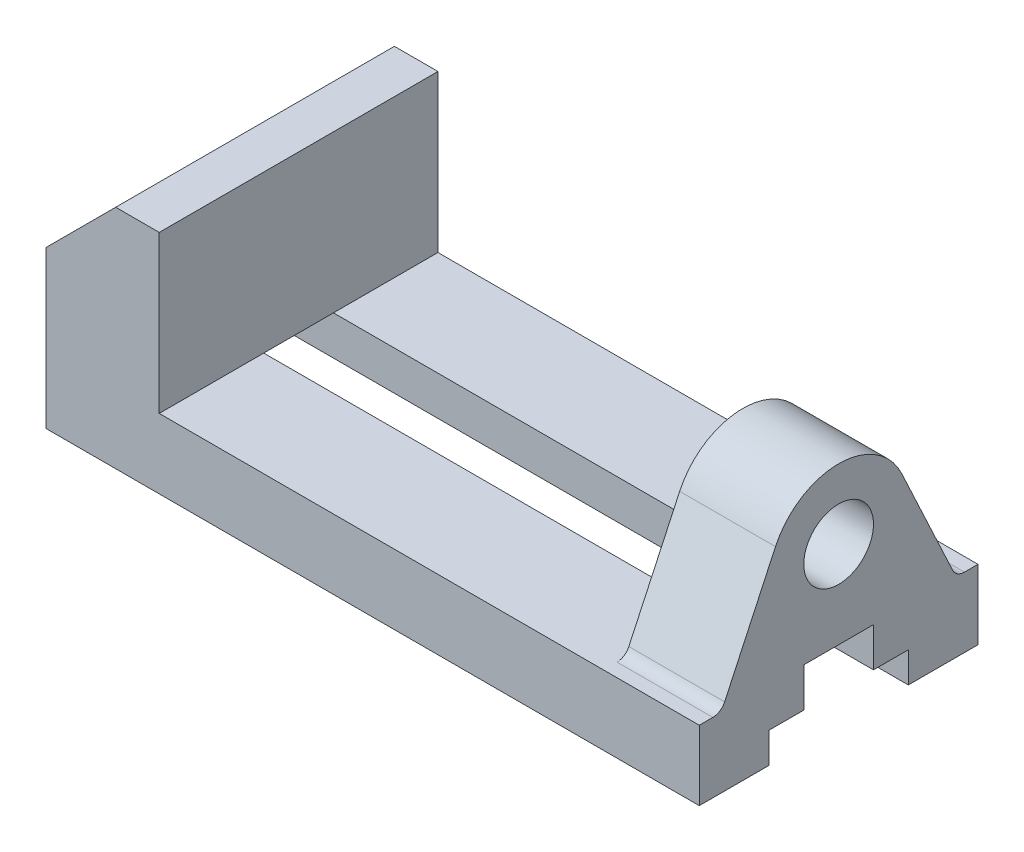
ISO-10303-21;
HEADER;
FILE_DESCRIPTION(('STEP AP214'),'2;1');
FILE_NAME('part.step','',(''),(''),'','','');
FILE_SCHEMA(('AUTOMOTIVE_DESIGN { 1 0 10303 214 1 1 1 1 }'));
ENDSEC;
DATA;
#1=APPLICATION_CONTEXT('core data for automotive mechanical design processes');
#2=APPLICATION_PROTOCOL_DEFINITION('international standard','automotive_design',2000,#1);
#3=PRODUCT_CONTEXT('',#1,'mechanical');
#4=PRODUCT('Part','Part','',(#3));
#5=PRODUCT_RELATED_PRODUCT_CATEGORY('part','',(#4));
#6=PRODUCT_DEFINITION_FORMATION('','',#4);
#7=PRODUCT_DEFINITION_CONTEXT('part definition',#1,'design');
#8=PRODUCT_DEFINITION('design','',#6,#7);
#9=PRODUCT_DEFINITION_SHAPE('','',#8);
#10=(LENGTH_UNIT() NAMED_UNIT(*) SI_UNIT(.MILLI.,.METRE.));
#11=(NAMED_UNIT(*) PLANE_ANGLE_UNIT() SI_UNIT($,.RADIAN.));
#12=(NAMED_UNIT(*) SI_UNIT($,.STERADIAN.) SOLID_ANGLE_UNIT());
#13=UNCERTAINTY_MEASURE_WITH_UNIT(LENGTH_MEASURE(1.E-05),#10,'distance_accuracy_value','');
#14=(GEOMETRIC_REPRESENTATION_CONTEXT(3) GLOBAL_UNCERTAINTY_ASSIGNED_CONTEXT((#13)) GLOBAL_UNIT_ASSIGNED_CONTEXT((#10,
#11,#12)) REPRESENTATION_CONTEXT('',''));
#15=CARTESIAN_POINT('',(0.,0.,0.));
#16=DIRECTION('',(0.,0.,1.));
#17=DIRECTION('',(1.,0.,0.));
#18=AXIS2_PLACEMENT_3D('',#15,#16,#17);
#19=CARTESIAN_POINT('',(0.,0.,32.));
#20=DIRECTION('',(0.,1.,0.));
#21=DIRECTION('',(0.,0.,1.));
#22=AXIS2_PLACEMENT_3D('',#19,#20,#21);
#23=PLANE('',#22);
#24=CARTESIAN_POINT('',(42.,0.,22.));
#25=DIRECTION('',(0.,1.,0.));
#26=DIRECTION('',(0.,0.,1.));
#27=AXIS2_PLACEMENT_3D('',#24,#25,#26);
#28=CIRCLE('',#27,3.);
#29=CARTESIAN_POINT('',(42.,0.,25.));
#30=VERTEX_POINT('',#29);
#31=EDGE_CURVE('E215',#30,#30,#28,.T.);
#32=ORIENTED_EDGE('',*,*,#31,.T.);
#33=EDGE_LOOP('',(#32));
#34=FACE_BOUND('',#33,.T.);
#35=CARTESIAN_POINT('',(112.,0.,22.));
#36=DIRECTION('',(0.,1.,0.));
#37=DIRECTION('',(0.,0.,1.));
#38=AXIS2_PLACEMENT_3D('',#35,#36,#37);
#39=CIRCLE('',#38,3.);
#40=CARTESIAN_POINT('',(112.,0.,25.));
#41=VERTEX_POINT('',#40);
#42=EDGE_CURVE('E227',#41,#41,#39,.T.);
#43=ORIENTED_EDGE('',*,*,#42,.T.);
#44=EDGE_LOOP('',(#43));
#45=FACE_BOUND('',#44,.T.);
#46=DIRECTION('',(0.,0.,-1.));
#47=VECTOR('',#46,1.);
#48=CARTESIAN_POINT('',(0.,0.,32.));
#49=LINE('',#48,#47);
#50=CARTESIAN_POINT('',(0.,0.,32.));
#51=VERTEX_POINT('',#50);
#52=CARTESIAN_POINT('',(0.,0.,16.));
#53=VERTEX_POINT('',#52);
#54=EDGE_CURVE('E380',#51,#53,#49,.T.);
#55=ORIENTED_EDGE('',*,*,#54,.T.);
#56=DIRECTION('',(1.,0.,0.));
#57=VECTOR('',#56,1.);
#58=CARTESIAN_POINT('',(0.,0.,16.));
#59=LINE('',#58,#57);
#60=CARTESIAN_POINT('',(150.,0.,16.));
#61=VERTEX_POINT('',#60);
#62=EDGE_CURVE('E270',#53,#61,#59,.T.);
#63=ORIENTED_EDGE('',*,*,#62,.T.);
#64=DIRECTION('',(0.,0.,-1.));
#65=VECTOR('',#64,1.);
#66=CARTESIAN_POINT('',(150.,0.,32.));
#67=LINE('',#66,#65);
#68=CARTESIAN_POINT('',(150.,0.,32.));
#69=VERTEX_POINT('',#68);
#70=EDGE_CURVE('E376',#69,#61,#67,.T.);
#71=ORIENTED_EDGE('',*,*,#70,.F.);
#72=DIRECTION('',(1.,0.,0.));
#73=VECTOR('',#72,1.);
#74=CARTESIAN_POINT('',(0.,0.,32.));
#75=LINE('',#74,#73);
#76=EDGE_CURVE('E329',#51,#69,#75,.T.);
#77=ORIENTED_EDGE('',*,*,#76,.F.);
#78=EDGE_LOOP('',(#55,#63,#71,#77));
#79=FACE_BOUND('',#78,.T.);
#80=ADVANCED_FACE('F32',(#34,#45,#79),#23,.F.);
#81=CARTESIAN_POINT('',(150.,16.,32.));
#82=DIRECTION('',(0.,-1.,0.));
#83=DIRECTION('',(1.,0.,0.));
#84=AXIS2_PLACEMENT_3D('',#81,#82,#83);
#85=PLANE('',#84);
#86=DIRECTION('',(0.,0.,-1.));
#87=VECTOR('',#86,1.);
#88=CARTESIAN_POINT('',(128.,16.,26.9801998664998));
#89=LINE('',#88,#87);
#90=CARTESIAN_POINT('',(128.,16.,28.8914106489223));
#91=VERTEX_POINT('',#90);
#92=CARTESIAN_POINT('',(128.,16.,8.));
#93=VERTEX_POINT('',#92);
#94=EDGE_CURVE('E308',#91,#93,#89,.T.);
#95=ORIENTED_EDGE('',*,*,#94,.T.);
#96=DIRECTION('',(1.,0.,0.));
#97=VECTOR('',#96,1.);
#98=CARTESIAN_POINT('',(0.,16.,8.));
#99=LINE('',#98,#97);
#100=CARTESIAN_POINT('',(26.,16.,8.));
#101=VERTEX_POINT('',#100);
#102=EDGE_CURVE('E55',#101,#93,#99,.T.);
#103=ORIENTED_EDGE('',*,*,#102,.F.);
#104=DIRECTION('',(0.,0.,-1.));
#105=VECTOR('',#104,1.);
#106=CARTESIAN_POINT('',(26.,16.,32.));
#107=LINE('',#106,#105);
#108=CARTESIAN_POINT('',(26.,16.,32.));
#109=VERTEX_POINT('',#108);
#110=EDGE_CURVE('E368',#109,#101,#107,.T.);
#111=ORIENTED_EDGE('',*,*,#110,.F.);
#112=DIRECTION('',(-1.,0.,0.));
#113=VECTOR('',#112,1.);
#114=CARTESIAN_POINT('',(150.,16.,32.));
#115=LINE('',#114,#113);
#116=CARTESIAN_POINT('',(150.,16.,32.));
#117=VERTEX_POINT('',#116);
#118=EDGE_CURVE('E334',#117,#109,#115,.T.);
#119=ORIENTED_EDGE('',*,*,#118,.F.);
#120=DIRECTION('',(0.,0.,-1.));
#121=VECTOR('',#120,1.);
#122=CARTESIAN_POINT('',(150.,16.,32.));
#123=LINE('',#122,#121);
#124=CARTESIAN_POINT('',(150.,16.,28.8914106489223));
#125=VERTEX_POINT('',#124);
#126=EDGE_CURVE('E372',#117,#125,#123,.T.);
#127=ORIENTED_EDGE('',*,*,#126,.T.);
#128=DIRECTION('',(1.,0.,0.));
#129=VECTOR('',#128,1.);
#130=CARTESIAN_POINT('',(150.,16.,28.8914106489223));
#131=LINE('',#130,#129);
#132=EDGE_CURVE('E383',#125,#91,#131,.F.);
#133=ORIENTED_EDGE('',*,*,#132,.T.);
#134=EDGE_LOOP('',(#95,#103,#111,#119,#127,#133));
#135=FACE_BOUND('',#134,.T.);
#136=ADVANCED_FACE('F408',(#135),#85,.F.);
#137=CARTESIAN_POINT('',(0.,36.,32.));
#138=DIRECTION('',(1.,0.,0.));
#139=DIRECTION('',(0.,1.,0.));
#140=AXIS2_PLACEMENT_3D('',#137,#138,#139);
#141=PLANE('',#140);
#142=DIRECTION('',(0.,0.,1.));
#143=VECTOR('',#142,1.);
#144=CARTESIAN_POINT('',(0.,7.,16.));
#145=LINE('',#144,#143);
#146=CARTESIAN_POINT('',(0.,7.,8.));
#147=VERTEX_POINT('',#146);
#148=CARTESIAN_POINT('',(0.,7.,16.));
#149=VERTEX_POINT('',#148);
#150=EDGE_CURVE('E247',#147,#149,#145,.T.);
#151=ORIENTED_EDGE('',*,*,#150,.T.);
#152=DIRECTION('',(0.,-1.,0.));
#153=VECTOR('',#152,1.);
#154=CARTESIAN_POINT('',(0.,0.,16.));
#155=LINE('',#154,#153);
#156=EDGE_CURVE('E250',#149,#53,#155,.T.);
#157=ORIENTED_EDGE('',*,*,#156,.T.);
#158=ORIENTED_EDGE('',*,*,#54,.F.);
#159=DIRECTION('',(0.,-1.,0.));
#160=VECTOR('',#159,1.);
#161=CARTESIAN_POINT('',(0.,36.,32.));
#162=LINE('',#161,#160);
#163=CARTESIAN_POINT('',(0.,36.,32.));
#164=VERTEX_POINT('',#163);
#165=EDGE_CURVE('E326',#164,#51,#162,.T.);
#166=ORIENTED_EDGE('',*,*,#165,.F.);
#167=DIRECTION('',(0.,0.,-1.));
#168=VECTOR('',#167,1.);
#169=CARTESIAN_POINT('',(0.,36.,32.));
#170=LINE('',#169,#168);
#171=CARTESIAN_POINT('',(0.,36.,-32.));
#172=VERTEX_POINT('',#171);
#173=EDGE_CURVE('E342',#164,#172,#170,.T.);
#174=ORIENTED_EDGE('',*,*,#173,.T.);
#175=DIRECTION('',(0.,-1.,0.));
#176=VECTOR('',#175,1.);
#177=CARTESIAN_POINT('',(0.,36.,-32.));
#178=LINE('',#177,#176);
#179=CARTESIAN_POINT('',(0.,0.,-32.));
#180=VERTEX_POINT('',#179);
#181=EDGE_CURVE('E324',#172,#180,#178,.T.);
#182=ORIENTED_EDGE('',*,*,#181,.T.);
#183=CARTESIAN_POINT('',(0.,0.,-16.));
#184=VERTEX_POINT('',#183);
#185=EDGE_CURVE('E379',#184,#180,#49,.T.);
#186=ORIENTED_EDGE('',*,*,#185,.F.);
#187=DIRECTION('',(0.,1.,0.));
#188=VECTOR('',#187,1.);
#189=CARTESIAN_POINT('',(0.,0.,-16.));
#190=LINE('',#189,#188);
#191=CARTESIAN_POINT('',(0.,7.,-16.));
#192=VERTEX_POINT('',#191);
#193=EDGE_CURVE('E231',#184,#192,#190,.T.);
#194=ORIENTED_EDGE('',*,*,#193,.T.);
#195=DIRECTION('',(0.,0.,1.));
#196=VECTOR('',#195,1.);
#197=CARTESIAN_POINT('',(0.,7.,-16.));
#198=LINE('',#197,#196);
#199=CARTESIAN_POINT('',(0.,7.,-8.));
#200=VERTEX_POINT('',#199);
#201=EDGE_CURVE('E234',#192,#200,#198,.T.);
#202=ORIENTED_EDGE('',*,*,#201,.T.);
#203=DIRECTION('',(0.,1.,0.));
#204=VECTOR('',#203,1.);
#205=CARTESIAN_POINT('',(0.,7.,-8.));
#206=LINE('',#205,#204);
#207=CARTESIAN_POINT('',(0.,16.,-8.));
#208=VERTEX_POINT('',#207);
#209=EDGE_CURVE('E238',#200,#208,#206,.T.);
#210=ORIENTED_EDGE('',*,*,#209,.T.);
#211=DIRECTION('',(0.,0.,1.));
#212=VECTOR('',#211,1.);
#213=CARTESIAN_POINT('',(0.,16.,8.));
#214=LINE('',#213,#212);
#215=CARTESIAN_POINT('',(0.,16.,8.));
#216=VERTEX_POINT('',#215);
#217=EDGE_CURVE('E241',#208,#216,#214,.T.);
#218=ORIENTED_EDGE('',*,*,#217,.T.);
#219=DIRECTION('',(0.,-1.,0.));
#220=VECTOR('',#219,1.);
#221=CARTESIAN_POINT('',(0.,7.,8.));
#222=LINE('',#221,#220);
#223=EDGE_CURVE('E244',#216,#147,#222,.T.);
#224=ORIENTED_EDGE('',*,*,#223,.T.);
#225=EDGE_LOOP('',(#151,#157,#158,#166,#174,#182,#186,#194,#202,#210,#218,#224));
#226=FACE_BOUND('',#225,.T.);
#227=ADVANCED_FACE('F466',(#226),#141,.F.);
#228=CARTESIAN_POINT('',(42.,0.,-22.));
#229=DIRECTION('',(0.,1.,0.));
#230=DIRECTION('',(0.,0.,1.));
#231=AXIS2_PLACEMENT_3D('',#228,#229,#230);
#232=CIRCLE('',#231,3.);
#233=CARTESIAN_POINT('',(42.,0.,-19.));
#234=VERTEX_POINT('',#233);
#235=EDGE_CURVE('E207',#234,#234,#232,.T.);
#236=ORIENTED_EDGE('',*,*,#235,.T.);
#237=EDGE_LOOP('',(#236));
#238=FACE_BOUND('',#237,.T.);
#239=CARTESIAN_POINT('',(112.,0.,-22.));
#240=DIRECTION('',(0.,1.,0.));
#241=DIRECTION('',(0.,0.,1.));
#242=AXIS2_PLACEMENT_3D('',#239,#240,#241);
#243=CIRCLE('',#242,3.);
#244=CARTESIAN_POINT('',(112.,0.,-19.));
#245=VERTEX_POINT('',#244);
#246=EDGE_CURVE('E221',#245,#245,#243,.T.);
#247=ORIENTED_EDGE('',*,*,#246,.T.);
#248=EDGE_LOOP('',(#247));
#249=FACE_BOUND('',#248,.T.);
#250=CARTESIAN_POINT('',(150.,0.,-16.));
#251=VERTEX_POINT('',#250);
#252=CARTESIAN_POINT('',(150.,0.,-32.));
#253=VERTEX_POINT('',#252);
#254=EDGE_CURVE('E375',#251,#253,#67,.T.);
#255=ORIENTED_EDGE('',*,*,#254,.F.);
#256=DIRECTION('',(1.,0.,0.));
#257=VECTOR('',#256,1.);
#258=CARTESIAN_POINT('',(0.,0.,-16.));
#259=LINE('',#258,#257);
#260=EDGE_CURVE('E47',#184,#251,#259,.T.);
#261=ORIENTED_EDGE('',*,*,#260,.F.);
#262=ORIENTED_EDGE('',*,*,#185,.T.);
#263=DIRECTION('',(1.,0.,0.));
#264=VECTOR('',#263,1.);
#265=CARTESIAN_POINT('',(0.,0.,-32.));
#266=LINE('',#265,#264);
#267=EDGE_CURVE('E345',#180,#253,#266,.T.);
#268=ORIENTED_EDGE('',*,*,#267,.T.);
#269=EDGE_LOOP('',(#255,#261,#262,#268));
#270=FACE_BOUND('',#269,.T.);
#271=ADVANCED_FACE('F490',(#238,#249,#270),#23,.F.);
#272=CARTESIAN_POINT('',(150.,0.,32.));
#273=DIRECTION('',(-1.,0.,0.));
#274=DIRECTION('',(0.,0.,1.));
#275=AXIS2_PLACEMENT_3D('',#272,#273,#274);
#276=PLANE('',#275);
#277=CARTESIAN_POINT('',(150.,36.,0.));
#278=DIRECTION('',(1.,0.,0.));
#279=DIRECTION('',(0.,0.,-1.));
#280=AXIS2_PLACEMENT_3D('',#277,#278,#279);
#281=CIRCLE('',#280,8.);
#282=CARTESIAN_POINT('',(150.,36.,-8.));
#283=VERTEX_POINT('',#282);
#284=EDGE_CURVE('E296',#283,#283,#281,.T.);
#285=ORIENTED_EDGE('',*,*,#284,.F.);
#286=EDGE_LOOP('',(#285));
#287=FACE_BOUND('',#286,.T.);
#288=ORIENTED_EDGE('',*,*,#70,.T.);
#289=DIRECTION('',(0.,-1.,0.));
#290=VECTOR('',#289,1.);
#291=CARTESIAN_POINT('',(150.,0.,16.));
#292=LINE('',#291,#290);
#293=CARTESIAN_POINT('',(150.,7.,16.));
#294=VERTEX_POINT('',#293);
#295=EDGE_CURVE('E235',#294,#61,#292,.T.);
#296=ORIENTED_EDGE('',*,*,#295,.F.);
#297=DIRECTION('',(0.,0.,1.));
#298=VECTOR('',#297,1.);
#299=CARTESIAN_POINT('',(150.,7.,16.));
#300=LINE('',#299,#298);
#301=CARTESIAN_POINT('',(150.,7.,8.));
#302=VERTEX_POINT('',#301);
#303=EDGE_CURVE('E266',#302,#294,#300,.T.);
#304=ORIENTED_EDGE('',*,*,#303,.F.);
#305=DIRECTION('',(0.,-1.,0.));
#306=VECTOR('',#305,1.);
#307=CARTESIAN_POINT('',(150.,7.,8.));
#308=LINE('',#307,#306);
#309=CARTESIAN_POINT('',(150.,16.,8.));
#310=VERTEX_POINT('',#309);
#311=EDGE_CURVE('E263',#310,#302,#308,.T.);
#312=ORIENTED_EDGE('',*,*,#311,.F.);
#313=DIRECTION('',(0.,0.,1.));
#314=VECTOR('',#313,1.);
#315=CARTESIAN_POINT('',(150.,16.,8.));
#316=LINE('',#315,#314);
#317=CARTESIAN_POINT('',(150.,16.,-8.));
#318=VERTEX_POINT('',#317);
#319=EDGE_CURVE('E260',#318,#310,#316,.T.);
#320=ORIENTED_EDGE('',*,*,#319,.F.);
#321=DIRECTION('',(0.,1.,0.));
#322=VECTOR('',#321,1.);
#323=CARTESIAN_POINT('',(150.,7.,-8.));
#324=LINE('',#323,#322);
#325=CARTESIAN_POINT('',(150.,7.,-8.));
#326=VERTEX_POINT('',#325);
#327=EDGE_CURVE('E257',#326,#318,#324,.T.);
#328=ORIENTED_EDGE('',*,*,#327,.F.);
#329=DIRECTION('',(0.,0.,1.));
#330=VECTOR('',#329,1.);
#331=CARTESIAN_POINT('',(150.,7.,-16.));
#332=LINE('',#331,#330);
#333=CARTESIAN_POINT('',(150.,7.,-16.));
#334=VERTEX_POINT('',#333);
#335=EDGE_CURVE('E254',#334,#326,#332,.T.);
#336=ORIENTED_EDGE('',*,*,#335,.F.);
#337=DIRECTION('',(0.,1.,0.));
#338=VECTOR('',#337,1.);
#339=CARTESIAN_POINT('',(150.,0.,-16.));
#340=LINE('',#339,#338);
#341=EDGE_CURVE('E230',#251,#334,#340,.T.);
#342=ORIENTED_EDGE('',*,*,#341,.F.);
#343=ORIENTED_EDGE('',*,*,#254,.T.);
#344=DIRECTION('',(0.,1.,0.));
#345=VECTOR('',#344,1.);
#346=CARTESIAN_POINT('',(150.,0.,-32.));
#347=LINE('',#346,#345);
#348=CARTESIAN_POINT('',(150.,16.,-32.));
#349=VERTEX_POINT('',#348);
#350=EDGE_CURVE('E348',#253,#349,#347,.T.);
#351=ORIENTED_EDGE('',*,*,#350,.T.);
#352=CARTESIAN_POINT('',(150.,16.,-28.8914106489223));
#353=VERTEX_POINT('',#352);
#354=EDGE_CURVE('E371',#353,#349,#123,.T.);
#355=ORIENTED_EDGE('',*,*,#354,.F.);
#356=CARTESIAN_POINT('',(150.,19.,-28.8914106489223));
#357=DIRECTION('',(-1.,0.,0.));
#358=DIRECTION('',(0.,0.,1.));
#359=AXIS2_PLACEMENT_3D('',#356,#357,#358);
#360=CIRCLE('',#359,3.);
#361=CARTESIAN_POINT('',(150.,17.7321452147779,-26.1724872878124));
#362=VERTEX_POINT('',#361);
#363=EDGE_CURVE('E394',#353,#362,#360,.T.);
#364=ORIENTED_EDGE('',*,*,#363,.T.);
#365=DIRECTION('',(0.,0.906307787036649,0.4226182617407));
#366=VECTOR('',#365,1.);
#367=CARTESIAN_POINT('',(150.,42.7618921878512,-14.5009245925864));
#368=LINE('',#367,#366);
#369=CARTESIAN_POINT('',(150.,42.7618921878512,-14.5009245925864));
#370=VERTEX_POINT('',#369);
#371=EDGE_CURVE('E304',#362,#370,#368,.T.);
#372=ORIENTED_EDGE('',*,*,#371,.T.);
#373=CARTESIAN_POINT('',(150.,36.,0.));
#374=DIRECTION('',(1.,0.,0.));
#375=DIRECTION('',(0.,0.,-1.));
#376=AXIS2_PLACEMENT_3D('',#373,#374,#375);
#377=CIRCLE('',#376,16.);
#378=CARTESIAN_POINT('',(150.,42.7618921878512,14.5009245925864));
#379=VERTEX_POINT('',#378);
#380=EDGE_CURVE('E299',#370,#379,#377,.T.);
#381=ORIENTED_EDGE('',*,*,#380,.T.);
#382=DIRECTION('',(0.,-0.90630778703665,0.4226182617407));
#383=VECTOR('',#382,1.);
#384=CARTESIAN_POINT('',(150.,42.7618921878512,14.5009245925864));
#385=LINE('',#384,#383);
#386=CARTESIAN_POINT('',(150.,17.7321452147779,26.1724872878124));
#387=VERTEX_POINT('',#386);
#388=EDGE_CURVE('E317',#379,#387,#385,.T.);
#389=ORIENTED_EDGE('',*,*,#388,.T.);
#390=CARTESIAN_POINT('',(150.,19.,28.8914106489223));
#391=DIRECTION('',(-1.,0.,0.));
#392=DIRECTION('',(0.,0.,1.));
#393=AXIS2_PLACEMENT_3D('',#390,#391,#392);
#394=CIRCLE('',#393,3.);
#395=EDGE_CURVE('E40',#387,#125,#394,.T.);
#396=ORIENTED_EDGE('',*,*,#395,.T.);
#397=ORIENTED_EDGE('',*,*,#126,.F.);
#398=DIRECTION('',(0.,1.,0.));
#399=VECTOR('',#398,1.);
#400=CARTESIAN_POINT('',(150.,0.,32.));
#401=LINE('',#400,#399);
#402=EDGE_CURVE('E332',#69,#117,#401,.T.);
#403=ORIENTED_EDGE('',*,*,#402,.F.);
#404=EDGE_LOOP('',(#288,#296,#304,#312,#320,#328,#336,#342,#343,#351,#355,#364,#372,#381,#389,
#396,#397,#403));
#405=FACE_BOUND('',#404,.T.);
#406=ADVANCED_FACE('F400',(#287,#405),#276,.F.);
#407=CARTESIAN_POINT('',(26.,16.,-8.));
#408=VERTEX_POINT('',#407);
#409=CARTESIAN_POINT('',(26.,16.,-32.));
#410=VERTEX_POINT('',#409);
#411=EDGE_CURVE('E367',#408,#410,#107,.T.);
#412=ORIENTED_EDGE('',*,*,#411,.F.);
#413=DIRECTION('',(1.,0.,0.));
#414=VECTOR('',#413,1.);
#415=CARTESIAN_POINT('',(0.,16.,-8.));
#416=LINE('',#415,#414);
#417=CARTESIAN_POINT('',(128.,16.,-8.));
#418=VERTEX_POINT('',#417);
#419=EDGE_CURVE('E284',#408,#418,#416,.T.);
#420=ORIENTED_EDGE('',*,*,#419,.T.);
#421=CARTESIAN_POINT('',(128.,16.,-28.8914106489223));
#422=VERTEX_POINT('',#421);
#423=EDGE_CURVE('E307',#418,#422,#89,.T.);
#424=ORIENTED_EDGE('',*,*,#423,.T.);
#425=DIRECTION('',(1.,0.,0.));
#426=VECTOR('',#425,1.);
#427=CARTESIAN_POINT('',(150.,16.,-28.8914106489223));
#428=LINE('',#427,#426);
#429=EDGE_CURVE('E386',#422,#353,#428,.T.);
#430=ORIENTED_EDGE('',*,*,#429,.T.);
#431=ORIENTED_EDGE('',*,*,#354,.T.);
#432=DIRECTION('',(-1.,0.,0.));
#433=VECTOR('',#432,1.);
#434=CARTESIAN_POINT('',(150.,16.,-32.));
#435=LINE('',#434,#433);
#436=EDGE_CURVE('E351',#349,#410,#435,.T.);
#437=ORIENTED_EDGE('',*,*,#436,.T.);
#438=EDGE_LOOP('',(#412,#420,#424,#430,#431,#437));
#439=FACE_BOUND('',#438,.T.);
#440=ADVANCED_FACE('F433',(#439),#85,.F.);
#441=CARTESIAN_POINT('',(26.,16.,32.));
#442=DIRECTION('',(-1.,0.,0.));
#443=DIRECTION('',(0.,-1.,0.));
#444=AXIS2_PLACEMENT_3D('',#441,#442,#443);
#445=PLANE('',#444);
#446=DIRECTION('',(0.,1.,0.));
#447=VECTOR('',#446,1.);
#448=CARTESIAN_POINT('',(26.,16.,-32.));
#449=LINE('',#448,#447);
#450=CARTESIAN_POINT('',(26.,52.,-32.));
#451=VERTEX_POINT('',#450);
#452=EDGE_CURVE('E354',#410,#451,#449,.T.);
#453=ORIENTED_EDGE('',*,*,#452,.T.);
#454=DIRECTION('',(0.,0.,-1.));
#455=VECTOR('',#454,1.);
#456=CARTESIAN_POINT('',(26.,52.,32.));
#457=LINE('',#456,#455);
#458=CARTESIAN_POINT('',(26.,52.,32.));
#459=VERTEX_POINT('',#458);
#460=EDGE_CURVE('E364',#459,#451,#457,.T.);
#461=ORIENTED_EDGE('',*,*,#460,.F.);
#462=DIRECTION('',(0.,1.,0.));
#463=VECTOR('',#462,1.);
#464=CARTESIAN_POINT('',(26.,16.,32.));
#465=LINE('',#464,#463);
#466=EDGE_CURVE('E336',#109,#459,#465,.T.);
#467=ORIENTED_EDGE('',*,*,#466,.F.);
#468=ORIENTED_EDGE('',*,*,#110,.T.);
#469=DIRECTION('',(0.,0.,-1.));
#470=VECTOR('',#469,1.);
#471=CARTESIAN_POINT('',(26.,16.,32.));
#472=LINE('',#471,#470);
#473=EDGE_CURVE('E273',#101,#408,#472,.T.);
#474=ORIENTED_EDGE('',*,*,#473,.T.);
#475=ORIENTED_EDGE('',*,*,#411,.T.);
#476=EDGE_LOOP('',(#453,#461,#467,#468,#474,#475));
#477=FACE_BOUND('',#476,.T.);
#478=ADVANCED_FACE('F446',(#477),#445,.F.);
#479=CARTESIAN_POINT('',(26.,52.,32.));
#480=DIRECTION('',(0.,-1.,0.));
#481=DIRECTION('',(0.,0.,-1.));
#482=AXIS2_PLACEMENT_3D('',#479,#480,#481);
#483=PLANE('',#482);
#484=DIRECTION('',(-1.,0.,0.));
#485=VECTOR('',#484,1.);
#486=CARTESIAN_POINT('',(26.,52.,-32.));
#487=LINE('',#486,#485);
#488=CARTESIAN_POINT('',(16.,52.,-32.));
#489=VERTEX_POINT('',#488);
#490=EDGE_CURVE('E356',#451,#489,#487,.T.);
#491=ORIENTED_EDGE('',*,*,#490,.T.);
#492=DIRECTION('',(0.,0.,-1.));
#493=VECTOR('',#492,1.);
#494=CARTESIAN_POINT('',(16.,52.,32.));
#495=LINE('',#494,#493);
#496=CARTESIAN_POINT('',(16.,52.,32.));
#497=VERTEX_POINT('',#496);
#498=EDGE_CURVE('E361',#497,#489,#495,.T.);
#499=ORIENTED_EDGE('',*,*,#498,.F.);
#500=DIRECTION('',(-1.,0.,0.));
#501=VECTOR('',#500,1.);
#502=CARTESIAN_POINT('',(26.,52.,32.));
#503=LINE('',#502,#501);
#504=EDGE_CURVE('E338',#459,#497,#503,.T.);
#505=ORIENTED_EDGE('',*,*,#504,.F.);
#506=ORIENTED_EDGE('',*,*,#460,.T.);
#507=EDGE_LOOP('',(#491,#499,#505,#506));
#508=FACE_BOUND('',#507,.T.);
#509=ADVANCED_FACE('F519',(#508),#483,.F.);
#510=CARTESIAN_POINT('',(16.,52.,32.));
#511=DIRECTION('',(0.707106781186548,-0.707106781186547,0.));
#512=DIRECTION('',(0.707106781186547,0.707106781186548,0.));
#513=AXIS2_PLACEMENT_3D('',#510,#511,#512);
#514=PLANE('',#513);
#515=DIRECTION('',(-0.707106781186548,-0.707106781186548,0.));
#516=VECTOR('',#515,1.);
#517=CARTESIAN_POINT('',(16.,52.,-32.));
#518=LINE('',#517,#516);
#519=EDGE_CURVE('E330',#489,#172,#518,.T.);
#520=ORIENTED_EDGE('',*,*,#519,.T.);
#521=ORIENTED_EDGE('',*,*,#173,.F.);
#522=DIRECTION('',(-0.707106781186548,-0.707106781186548,0.));
#523=VECTOR('',#522,1.);
#524=CARTESIAN_POINT('',(16.,52.,32.));
#525=LINE('',#524,#523);
#526=EDGE_CURVE('E340',#497,#164,#525,.T.);
#527=ORIENTED_EDGE('',*,*,#526,.F.);
#528=ORIENTED_EDGE('',*,*,#498,.T.);
#529=EDGE_LOOP('',(#520,#521,#527,#528));
#530=FACE_BOUND('',#529,.T.);
#531=ADVANCED_FACE('F516',(#530),#514,.F.);
#532=CARTESIAN_POINT('',(0.,0.,32.));
#533=DIRECTION('',(0.,0.,1.));
#534=DIRECTION('',(1.,0.,0.));
#535=AXIS2_PLACEMENT_3D('',#532,#533,#534);
#536=PLANE('',#535);
#537=ORIENTED_EDGE('',*,*,#165,.T.);
#538=ORIENTED_EDGE('',*,*,#76,.T.);
#539=ORIENTED_EDGE('',*,*,#402,.T.);
#540=ORIENTED_EDGE('',*,*,#118,.T.);
#541=ORIENTED_EDGE('',*,*,#466,.T.);
#542=ORIENTED_EDGE('',*,*,#504,.T.);
#543=ORIENTED_EDGE('',*,*,#526,.T.);
#544=EDGE_LOOP('',(#537,#538,#539,#540,#541,#542,#543));
#545=FACE_BOUND('',#544,.T.);
#546=ADVANCED_FACE('F523',(#545),#536,.T.);
#547=CARTESIAN_POINT('',(0.,0.,-32.));
#548=DIRECTION('',(0.,0.,1.));
#549=DIRECTION('',(1.,0.,0.));
#550=AXIS2_PLACEMENT_3D('',#547,#548,#549);
#551=PLANE('',#550);
#552=ORIENTED_EDGE('',*,*,#181,.F.);
#553=ORIENTED_EDGE('',*,*,#519,.F.);
#554=ORIENTED_EDGE('',*,*,#490,.F.);
#555=ORIENTED_EDGE('',*,*,#452,.F.);
#556=ORIENTED_EDGE('',*,*,#436,.F.);
#557=ORIENTED_EDGE('',*,*,#350,.F.);
#558=ORIENTED_EDGE('',*,*,#267,.F.);
#559=EDGE_LOOP('',(#552,#553,#554,#555,#556,#557,#558));
#560=FACE_BOUND('',#559,.T.);
#561=ADVANCED_FACE('F443',(#560),#551,.F.);
#562=CARTESIAN_POINT('',(128.,36.,0.));
#563=DIRECTION('',(1.,0.,0.));
#564=DIRECTION('',(0.,0.,-1.));
#565=AXIS2_PLACEMENT_3D('',#562,#563,#564);
#566=CYLINDRICAL_SURFACE('',#565,16.);
#567=ORIENTED_EDGE('',*,*,#380,.F.);
#568=DIRECTION('',(1.,0.,0.));
#569=VECTOR('',#568,1.);
#570=CARTESIAN_POINT('',(128.,42.7618921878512,-14.5009245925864));
#571=LINE('',#570,#569);
#572=CARTESIAN_POINT('',(128.,42.7618921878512,-14.5009245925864));
#573=VERTEX_POINT('',#572);
#574=EDGE_CURVE('E321',#573,#370,#571,.T.);
#575=ORIENTED_EDGE('',*,*,#574,.F.);
#576=CARTESIAN_POINT('',(128.,36.,0.));
#577=DIRECTION('',(1.,0.,0.));
#578=DIRECTION('',(0.,0.,-1.));
#579=AXIS2_PLACEMENT_3D('',#576,#577,#578);
#580=CIRCLE('',#579,16.);
#581=CARTESIAN_POINT('',(128.,42.7618921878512,14.5009245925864));
#582=VERTEX_POINT('',#581);
#583=EDGE_CURVE('E300',#573,#582,#580,.T.);
#584=ORIENTED_EDGE('',*,*,#583,.T.);
#585=DIRECTION('',(1.,0.,0.));
#586=VECTOR('',#585,1.);
#587=CARTESIAN_POINT('',(128.,42.7618921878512,14.5009245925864));
#588=LINE('',#587,#586);
#589=EDGE_CURVE('E314',#582,#379,#588,.T.);
#590=ORIENTED_EDGE('',*,*,#589,.T.);
#591=EDGE_LOOP('',(#567,#575,#584,#590));
#592=FACE_BOUND('',#591,.T.);
#593=ADVANCED_FACE('F420',(#592),#566,.T.);
#594=CARTESIAN_POINT('',(128.,42.7618921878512,-14.5009245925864));
#595=DIRECTION('',(0.,0.4226182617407,-0.90630778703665));
#596=DIRECTION('',(0.,0.90630778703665,0.4226182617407));
#597=AXIS2_PLACEMENT_3D('',#594,#595,#596);
#598=PLANE('',#597);
#599=ORIENTED_EDGE('',*,*,#371,.F.);
#600=DIRECTION('',(1.,0.,0.));
#601=VECTOR('',#600,1.);
#602=CARTESIAN_POINT('',(128.,17.7321452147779,-26.1724872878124));
#603=LINE('',#602,#601);
#604=CARTESIAN_POINT('',(128.,17.7321452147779,-26.1724872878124));
#605=VERTEX_POINT('',#604);
#606=EDGE_CURVE('E389',#362,#605,#603,.F.);
#607=ORIENTED_EDGE('',*,*,#606,.T.);
#608=DIRECTION('',(0.,0.906307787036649,0.4226182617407));
#609=VECTOR('',#608,1.);
#610=CARTESIAN_POINT('',(128.,42.7618921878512,-14.5009245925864));
#611=LINE('',#610,#609);
#612=EDGE_CURVE('E311',#605,#573,#611,.T.);
#613=ORIENTED_EDGE('',*,*,#612,.T.);
#614=ORIENTED_EDGE('',*,*,#574,.T.);
#615=EDGE_LOOP('',(#599,#607,#613,#614));
#616=FACE_BOUND('',#615,.T.);
#617=ADVANCED_FACE('F704',(#616),#598,.T.);
#618=CARTESIAN_POINT('',(128.,42.7618921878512,14.5009245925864));
#619=DIRECTION('',(0.,0.4226182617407,0.90630778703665));
#620=DIRECTION('',(0.,-0.90630778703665,0.4226182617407));
#621=AXIS2_PLACEMENT_3D('',#618,#619,#620);
#622=PLANE('',#621);
#623=DIRECTION('',(0.,-0.90630778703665,0.4226182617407));
#624=VECTOR('',#623,1.);
#625=CARTESIAN_POINT('',(128.,42.7618921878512,14.5009245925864));
#626=LINE('',#625,#624);
#627=CARTESIAN_POINT('',(128.,17.7321452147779,26.1724872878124));
#628=VERTEX_POINT('',#627);
#629=EDGE_CURVE('E303',#582,#628,#626,.T.);
#630=ORIENTED_EDGE('',*,*,#629,.T.);
#631=DIRECTION('',(1.,0.,0.));
#632=VECTOR('',#631,1.);
#633=CARTESIAN_POINT('',(128.,17.7321452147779,26.1724872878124));
#634=LINE('',#633,#632);
#635=EDGE_CURVE('E391',#628,#387,#634,.T.);
#636=ORIENTED_EDGE('',*,*,#635,.T.);
#637=ORIENTED_EDGE('',*,*,#388,.F.);
#638=ORIENTED_EDGE('',*,*,#589,.F.);
#639=EDGE_LOOP('',(#630,#636,#637,#638));
#640=FACE_BOUND('',#639,.T.);
#641=ADVANCED_FACE('F417',(#640),#622,.T.);
#642=CARTESIAN_POINT('',(128.,36.,0.));
#643=DIRECTION('',(1.,0.,0.));
#644=DIRECTION('',(0.,0.,-1.));
#645=AXIS2_PLACEMENT_3D('',#642,#643,#644);
#646=PLANE('',#645);
#647=CARTESIAN_POINT('',(128.,36.,0.));
#648=DIRECTION('',(1.,0.,0.));
#649=DIRECTION('',(0.,0.,-1.));
#650=AXIS2_PLACEMENT_3D('',#647,#648,#649);
#651=CIRCLE('',#650,8.);
#652=CARTESIAN_POINT('',(128.,36.,-8.));
#653=VERTEX_POINT('',#652);
#654=EDGE_CURVE('E293',#653,#653,#651,.F.);
#655=ORIENTED_EDGE('',*,*,#654,.F.);
#656=EDGE_LOOP('',(#655));
#657=FACE_BOUND('',#656,.T.);
#658=ORIENTED_EDGE('',*,*,#583,.F.);
#659=ORIENTED_EDGE('',*,*,#612,.F.);
#660=CARTESIAN_POINT('',(128.,19.,-28.8914106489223));
#661=DIRECTION('',(1.,0.,0.));
#662=DIRECTION('',(0.,0.,-1.));
#663=AXIS2_PLACEMENT_3D('',#660,#661,#662);
#664=CIRCLE('',#663,3.);
#665=EDGE_CURVE('E396',#605,#422,#664,.T.);
#666=ORIENTED_EDGE('',*,*,#665,.T.);
#667=ORIENTED_EDGE('',*,*,#423,.F.);
#668=EDGE_CURVE('E312',#93,#418,#89,.T.);
#669=ORIENTED_EDGE('',*,*,#668,.F.);
#670=ORIENTED_EDGE('',*,*,#94,.F.);
#671=CARTESIAN_POINT('',(128.,19.,28.8914106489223));
#672=DIRECTION('',(1.,0.,0.));
#673=DIRECTION('',(0.,0.,-1.));
#674=AXIS2_PLACEMENT_3D('',#671,#672,#673);
#675=CIRCLE('',#674,3.);
#676=EDGE_CURVE('E11',#91,#628,#675,.T.);
#677=ORIENTED_EDGE('',*,*,#676,.T.);
#678=ORIENTED_EDGE('',*,*,#629,.F.);
#679=EDGE_LOOP('',(#658,#659,#666,#667,#669,#670,#677,#678));
#680=FACE_BOUND('',#679,.T.);
#681=ADVANCED_FACE('F414',(#657,#680),#646,.F.);
#682=CARTESIAN_POINT('',(150.,19.,-28.8914106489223));
#683=DIRECTION('',(1.,0.,0.));
#684=DIRECTION('',(0.,1.,0.));
#685=AXIS2_PLACEMENT_3D('',#682,#683,#684);
#686=CYLINDRICAL_SURFACE('',#685,3.);
#687=ORIENTED_EDGE('',*,*,#665,.F.);
#688=ORIENTED_EDGE('',*,*,#606,.F.);
#689=ORIENTED_EDGE('',*,*,#363,.F.);
#690=ORIENTED_EDGE('',*,*,#429,.F.);
#691=EDGE_LOOP('',(#687,#688,#689,#690));
#692=FACE_BOUND('',#691,.T.);
#693=ADVANCED_FACE('F429',(#692),#686,.F.);
#694=CARTESIAN_POINT('',(128.,19.,28.8914106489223));
#695=DIRECTION('',(1.,0.,0.));
#696=DIRECTION('',(0.,1.,0.));
#697=AXIS2_PLACEMENT_3D('',#694,#695,#696);
#698=CYLINDRICAL_SURFACE('',#697,3.);
#699=ORIENTED_EDGE('',*,*,#676,.F.);
#700=ORIENTED_EDGE('',*,*,#132,.F.);
#701=ORIENTED_EDGE('',*,*,#395,.F.);
#702=ORIENTED_EDGE('',*,*,#635,.F.);
#703=EDGE_LOOP('',(#699,#700,#701,#702));
#704=FACE_BOUND('',#703,.T.);
#705=ADVANCED_FACE('F34',(#704),#698,.F.);
#706=CARTESIAN_POINT('',(-0.001000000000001,36.,0.));
#707=DIRECTION('',(1.,0.,0.));
#708=DIRECTION('',(0.,0.,-1.));
#709=AXIS2_PLACEMENT_3D('',#706,#707,#708);
#710=CYLINDRICAL_SURFACE('',#709,8.);
#711=ORIENTED_EDGE('',*,*,#284,.T.);
#712=EDGE_LOOP('',(#711));
#713=FACE_BOUND('',#712,.T.);
#714=ORIENTED_EDGE('',*,*,#654,.T.);
#715=EDGE_LOOP('',(#714));
#716=FACE_BOUND('',#715,.T.);
#717=ADVANCED_FACE('F541',(#713,#716),#710,.F.);
#718=CARTESIAN_POINT('',(0.,16.,8.));
#719=DIRECTION('',(0.,1.,0.));
#720=DIRECTION('',(0.,0.,1.));
#721=AXIS2_PLACEMENT_3D('',#718,#719,#720);
#722=PLANE('',#721);
#723=EDGE_CURVE('E278',#216,#101,#99,.T.);
#724=ORIENTED_EDGE('',*,*,#723,.F.);
#725=ORIENTED_EDGE('',*,*,#217,.F.);
#726=EDGE_CURVE('E281',#208,#408,#416,.T.);
#727=ORIENTED_EDGE('',*,*,#726,.T.);
#728=ORIENTED_EDGE('',*,*,#473,.F.);
#729=EDGE_LOOP('',(#724,#725,#727,#728));
#730=FACE_BOUND('',#729,.T.);
#731=ADVANCED_FACE('F449',(#730),#722,.F.);
#732=EDGE_CURVE('E285',#418,#318,#416,.T.);
#733=ORIENTED_EDGE('',*,*,#732,.T.);
#734=ORIENTED_EDGE('',*,*,#319,.T.);
#735=EDGE_CURVE('E280',#93,#310,#99,.T.);
#736=ORIENTED_EDGE('',*,*,#735,.F.);
#737=ORIENTED_EDGE('',*,*,#668,.T.);
#738=EDGE_LOOP('',(#733,#734,#736,#737));
#739=FACE_BOUND('',#738,.T.);
#740=ADVANCED_FACE('F457',(#739),#722,.F.);
#741=CARTESIAN_POINT('',(0.,0.,16.));
#742=DIRECTION('',(0.,0.,1.));
#743=DIRECTION('',(1.,0.,0.));
#744=AXIS2_PLACEMENT_3D('',#741,#742,#743);
#745=PLANE('',#744);
#746=ORIENTED_EDGE('',*,*,#295,.T.);
#747=ORIENTED_EDGE('',*,*,#62,.F.);
#748=ORIENTED_EDGE('',*,*,#156,.F.);
#749=DIRECTION('',(1.,0.,0.));
#750=VECTOR('',#749,1.);
#751=CARTESIAN_POINT('',(0.,7.,16.));
#752=LINE('',#751,#750);
#753=EDGE_CURVE('E274',#149,#294,#752,.T.);
#754=ORIENTED_EDGE('',*,*,#753,.T.);
#755=EDGE_LOOP('',(#746,#747,#748,#754));
#756=FACE_BOUND('',#755,.T.);
#757=ADVANCED_FACE('F527',(#756),#745,.F.);
#758=CARTESIAN_POINT('',(0.,7.,16.));
#759=DIRECTION('',(0.,1.,0.));
#760=DIRECTION('',(0.,0.,1.));
#761=AXIS2_PLACEMENT_3D('',#758,#759,#760);
#762=PLANE('',#761);
#763=ORIENTED_EDGE('',*,*,#303,.T.);
#764=ORIENTED_EDGE('',*,*,#753,.F.);
#765=ORIENTED_EDGE('',*,*,#150,.F.);
#766=DIRECTION('',(1.,0.,0.));
#767=VECTOR('',#766,1.);
#768=CARTESIAN_POINT('',(0.,7.,8.));
#769=LINE('',#768,#767);
#770=EDGE_CURVE('E276',#147,#302,#769,.T.);
#771=ORIENTED_EDGE('',*,*,#770,.T.);
#772=EDGE_LOOP('',(#763,#764,#765,#771));
#773=FACE_BOUND('',#772,.T.);
#774=ADVANCED_FACE('F462',(#773),#762,.F.);
#775=CARTESIAN_POINT('',(0.,7.,8.));
#776=DIRECTION('',(0.,0.,1.));
#777=DIRECTION('',(1.,0.,0.));
#778=AXIS2_PLACEMENT_3D('',#775,#776,#777);
#779=PLANE('',#778);
#780=ORIENTED_EDGE('',*,*,#311,.T.);
#781=ORIENTED_EDGE('',*,*,#770,.F.);
#782=ORIENTED_EDGE('',*,*,#223,.F.);
#783=ORIENTED_EDGE('',*,*,#723,.T.);
#784=ORIENTED_EDGE('',*,*,#102,.T.);
#785=ORIENTED_EDGE('',*,*,#735,.T.);
#786=EDGE_LOOP('',(#780,#781,#782,#783,#784,#785));
#787=FACE_BOUND('',#786,.T.);
#788=ADVANCED_FACE('F452',(#787),#779,.F.);
#789=CARTESIAN_POINT('',(0.,7.,-8.));
#790=DIRECTION('',(0.,0.,-1.));
#791=DIRECTION('',(-1.,0.,0.));
#792=AXIS2_PLACEMENT_3D('',#789,#790,#791);
#793=PLANE('',#792);
#794=ORIENTED_EDGE('',*,*,#327,.T.);
#795=ORIENTED_EDGE('',*,*,#732,.F.);
#796=ORIENTED_EDGE('',*,*,#419,.F.);
#797=ORIENTED_EDGE('',*,*,#726,.F.);
#798=ORIENTED_EDGE('',*,*,#209,.F.);
#799=DIRECTION('',(1.,0.,0.));
#800=VECTOR('',#799,1.);
#801=CARTESIAN_POINT('',(0.,7.,-8.));
#802=LINE('',#801,#800);
#803=EDGE_CURVE('E286',#200,#326,#802,.T.);
#804=ORIENTED_EDGE('',*,*,#803,.T.);
#805=EDGE_LOOP('',(#794,#795,#796,#797,#798,#804));
#806=FACE_BOUND('',#805,.T.);
#807=ADVANCED_FACE('F470',(#806),#793,.F.);
#808=CARTESIAN_POINT('',(0.,7.,-16.));
#809=DIRECTION('',(0.,1.,0.));
#810=DIRECTION('',(0.,0.,1.));
#811=AXIS2_PLACEMENT_3D('',#808,#809,#810);
#812=PLANE('',#811);
#813=ORIENTED_EDGE('',*,*,#335,.T.);
#814=ORIENTED_EDGE('',*,*,#803,.F.);
#815=ORIENTED_EDGE('',*,*,#201,.F.);
#816=DIRECTION('',(1.,0.,0.));
#817=VECTOR('',#816,1.);
#818=CARTESIAN_POINT('',(0.,7.,-16.));
#819=LINE('',#818,#817);
#820=EDGE_CURVE('E288',#192,#334,#819,.T.);
#821=ORIENTED_EDGE('',*,*,#820,.T.);
#822=EDGE_LOOP('',(#813,#814,#815,#821));
#823=FACE_BOUND('',#822,.T.);
#824=ADVANCED_FACE('F473',(#823),#812,.F.);
#825=CARTESIAN_POINT('',(0.,0.,-16.));
#826=DIRECTION('',(0.,0.,-1.));
#827=DIRECTION('',(-1.,0.,0.));
#828=AXIS2_PLACEMENT_3D('',#825,#826,#827);
#829=PLANE('',#828);
#830=ORIENTED_EDGE('',*,*,#341,.T.);
#831=ORIENTED_EDGE('',*,*,#820,.F.);
#832=ORIENTED_EDGE('',*,*,#193,.F.);
#833=ORIENTED_EDGE('',*,*,#260,.T.);
#834=EDGE_LOOP('',(#830,#831,#832,#833));
#835=FACE_BOUND('',#834,.T.);
#836=ADVANCED_FACE('F474',(#835),#829,.F.);
#837=CARTESIAN_POINT('',(112.,26.4839292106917,22.));
#838=DIRECTION('',(0.,1.,0.));
#839=DIRECTION('',(0.,0.,1.));
#840=AXIS2_PLACEMENT_3D('',#837,#838,#839);
#841=CYLINDRICAL_SURFACE('',#840,3.00000000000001);
#842=CARTESIAN_POINT('',(112.,10.,22.));
#843=DIRECTION('',(0.,1.,0.));
#844=DIRECTION('',(0.,0.,1.));
#845=AXIS2_PLACEMENT_3D('',#842,#843,#844);
#846=CIRCLE('',#845,3.00000000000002);
#847=CARTESIAN_POINT('',(112.,10.,25.));
#848=VERTEX_POINT('',#847);
#849=EDGE_CURVE('E224',#848,#848,#846,.T.);
#850=ORIENTED_EDGE('',*,*,#849,.T.);
#851=EDGE_LOOP('',(#850));
#852=FACE_BOUND('',#851,.T.);
#853=ORIENTED_EDGE('',*,*,#42,.F.);
#854=EDGE_LOOP('',(#853));
#855=FACE_BOUND('',#854,.T.);
#856=ADVANCED_FACE('F476',(#852,#855),#841,.F.);
#857=CARTESIAN_POINT('',(112.,10.,22.));
#858=DIRECTION('',(0.,-1.,0.));
#859=DIRECTION('',(0.,0.,-1.));
#860=AXIS2_PLACEMENT_3D('',#857,#858,#859);
#861=CONICAL_SURFACE('',#860,3.00000000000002,1.04719755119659);
#862=CARTESIAN_POINT('',(112.,11.7320508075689,22.));
#863=VERTEX_POINT('',#862);
#864=VERTEX_LOOP('',#863);
#865=FACE_BOUND('',#864,.T.);
#866=ORIENTED_EDGE('',*,*,#849,.F.);
#867=EDGE_LOOP('',(#866));
#868=FACE_BOUND('',#867,.T.);
#869=ADVANCED_FACE('F482',(#865,#868),#861,.F.);
#870=CARTESIAN_POINT('',(112.,26.4839292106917,-22.));
#871=DIRECTION('',(0.,1.,0.));
#872=DIRECTION('',(0.,0.,1.));
#873=AXIS2_PLACEMENT_3D('',#870,#871,#872);
#874=CYLINDRICAL_SURFACE('',#873,3.00000000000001);
#875=CARTESIAN_POINT('',(112.,10.,-22.));
#876=DIRECTION('',(0.,1.,0.));
#877=DIRECTION('',(0.,0.,1.));
#878=AXIS2_PLACEMENT_3D('',#875,#876,#877);
#879=CIRCLE('',#878,3.00000000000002);
#880=CARTESIAN_POINT('',(112.,10.,-19.));
#881=VERTEX_POINT('',#880);
#882=EDGE_CURVE('E218',#881,#881,#879,.T.);
#883=ORIENTED_EDGE('',*,*,#882,.T.);
#884=EDGE_LOOP('',(#883));
#885=FACE_BOUND('',#884,.T.);
#886=ORIENTED_EDGE('',*,*,#246,.F.);
#887=EDGE_LOOP('',(#886));
#888=FACE_BOUND('',#887,.T.);
#889=ADVANCED_FACE('F569',(#885,#888),#874,.F.);
#890=CARTESIAN_POINT('',(112.,10.,-22.));
#891=DIRECTION('',(0.,-1.,0.));
#892=DIRECTION('',(0.,0.,-1.));
#893=AXIS2_PLACEMENT_3D('',#890,#891,#892);
#894=CONICAL_SURFACE('',#893,3.00000000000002,1.04719755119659);
#895=CARTESIAN_POINT('',(112.,11.7320508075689,-22.));
#896=VERTEX_POINT('',#895);
#897=VERTEX_LOOP('',#896);
#898=FACE_BOUND('',#897,.T.);
#899=ORIENTED_EDGE('',*,*,#882,.F.);
#900=EDGE_LOOP('',(#899));
#901=FACE_BOUND('',#900,.T.);
#902=ADVANCED_FACE('F591',(#898,#901),#894,.F.);
#903=CARTESIAN_POINT('',(42.,26.4839292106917,22.));
#904=DIRECTION('',(0.,1.,0.));
#905=DIRECTION('',(0.,0.,1.));
#906=AXIS2_PLACEMENT_3D('',#903,#904,#905);
#907=CYLINDRICAL_SURFACE('',#906,3.00000000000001);
#908=CARTESIAN_POINT('',(42.,9.99999999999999,22.));
#909=DIRECTION('',(0.,1.,0.));
#910=DIRECTION('',(0.,0.,1.));
#911=AXIS2_PLACEMENT_3D('',#908,#909,#910);
#912=CIRCLE('',#911,3.00000000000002);
#913=CARTESIAN_POINT('',(42.,9.99999999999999,25.));
#914=VERTEX_POINT('',#913);
#915=EDGE_CURVE('E210',#914,#914,#912,.T.);
#916=ORIENTED_EDGE('',*,*,#915,.T.);
#917=EDGE_LOOP('',(#916));
#918=FACE_BOUND('',#917,.T.);
#919=ORIENTED_EDGE('',*,*,#31,.F.);
#920=EDGE_LOOP('',(#919));
#921=FACE_BOUND('',#920,.T.);
#922=ADVANCED_FACE('F601',(#918,#921),#907,.F.);
#923=CARTESIAN_POINT('',(42.,9.99999999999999,22.));
#924=DIRECTION('',(0.,-1.,0.));
#925=DIRECTION('',(0.,0.,-1.));
#926=AXIS2_PLACEMENT_3D('',#923,#924,#925);
#927=CONICAL_SURFACE('',#926,3.00000000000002,1.04719755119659);
#928=CARTESIAN_POINT('',(42.,11.7320508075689,22.));
#929=VERTEX_POINT('',#928);
#930=VERTEX_LOOP('',#929);
#931=FACE_BOUND('',#930,.T.);
#932=ORIENTED_EDGE('',*,*,#915,.F.);
#933=EDGE_LOOP('',(#932));
#934=FACE_BOUND('',#933,.T.);
#935=ADVANCED_FACE('F611',(#931,#934),#927,.F.);
#936=CARTESIAN_POINT('',(42.,26.4839292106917,-22.));
#937=DIRECTION('',(0.,1.,0.));
#938=DIRECTION('',(0.,0.,1.));
#939=AXIS2_PLACEMENT_3D('',#936,#937,#938);
#940=CYLINDRICAL_SURFACE('',#939,3.00000000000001);
#941=CARTESIAN_POINT('',(42.,9.99999999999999,-22.));
#942=DIRECTION('',(0.,1.,0.));
#943=DIRECTION('',(0.,0.,1.));
#944=AXIS2_PLACEMENT_3D('',#941,#942,#943);
#945=CIRCLE('',#944,3.00000000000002);
#946=CARTESIAN_POINT('',(42.,9.99999999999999,-19.));
#947=VERTEX_POINT('',#946);
#948=EDGE_CURVE('E205',#947,#947,#945,.T.);
#949=ORIENTED_EDGE('',*,*,#948,.T.);
#950=EDGE_LOOP('',(#949));
#951=FACE_BOUND('',#950,.T.);
#952=ORIENTED_EDGE('',*,*,#235,.F.);
#953=EDGE_LOOP('',(#952));
#954=FACE_BOUND('',#953,.T.);
#955=ADVANCED_FACE('F201',(#951,#954),#940,.F.);
#956=CARTESIAN_POINT('',(42.,9.99999999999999,-22.));
#957=DIRECTION('',(0.,-1.,0.));
#958=DIRECTION('',(0.,0.,-1.));
#959=AXIS2_PLACEMENT_3D('',#956,#957,#958);
#960=CONICAL_SURFACE('',#959,3.00000000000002,1.04719755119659);
#961=CARTESIAN_POINT('',(42.,11.7320508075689,-22.));
#962=VERTEX_POINT('',#961);
#963=VERTEX_LOOP('',#962);
#964=FACE_BOUND('',#963,.T.);
#965=ORIENTED_EDGE('',*,*,#948,.F.);
#966=EDGE_LOOP('',(#965));
#967=FACE_BOUND('',#966,.T.);
#968=ADVANCED_FACE('F198',(#964,#967),#960,.F.);
#969=CLOSED_SHELL('',(#80,#136,#227,#271,#406,#440,#478,#509,#531,#546,#561,#593,#617,#641,#681,
#693,#705,#717,#731,#740,#757,#774,#788,#807,#824,#836,#856,#869,#889,#902,#922,#935,#955,#968));
#970=MANIFOLD_SOLID_BREP('B2',#969);
#971=ADVANCED_BREP_SHAPE_REPRESENTATION('',(#18,#970),#14);
#972=SHAPE_DEFINITION_REPRESENTATION(#9,#971);
ENDSEC;
END-ISO-10303-21;
